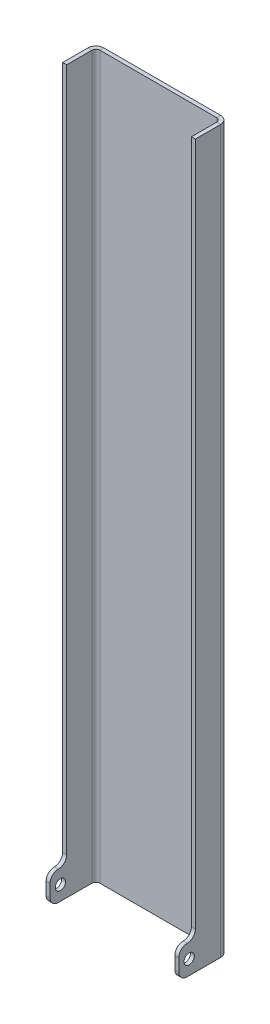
ISO-10303-21;
HEADER;
FILE_DESCRIPTION(('STEP AP214'),'2;1');
FILE_NAME('part.step','',(''),(''),'','','');
FILE_SCHEMA(('AUTOMOTIVE_DESIGN { 1 0 10303 214 1 1 1 1 }'));
ENDSEC;
DATA;
#1=APPLICATION_CONTEXT('core data for automotive mechanical design processes');
#2=APPLICATION_PROTOCOL_DEFINITION('international standard','automotive_design',2000,#1);
#3=PRODUCT_CONTEXT('',#1,'mechanical');
#4=PRODUCT('Part','Part','',(#3));
#5=PRODUCT_RELATED_PRODUCT_CATEGORY('part','',(#4));
#6=PRODUCT_DEFINITION_FORMATION('','',#4);
#7=PRODUCT_DEFINITION_CONTEXT('part definition',#1,'design');
#8=PRODUCT_DEFINITION('design','',#6,#7);
#9=PRODUCT_DEFINITION_SHAPE('','',#8);
#10=(LENGTH_UNIT() NAMED_UNIT(*) SI_UNIT(.MILLI.,.METRE.));
#11=(NAMED_UNIT(*) PLANE_ANGLE_UNIT() SI_UNIT($,.RADIAN.));
#12=(NAMED_UNIT(*) SI_UNIT($,.STERADIAN.) SOLID_ANGLE_UNIT());
#13=UNCERTAINTY_MEASURE_WITH_UNIT(LENGTH_MEASURE(1.E-05),#10,'distance_accuracy_value','');
#14=(GEOMETRIC_REPRESENTATION_CONTEXT(3) GLOBAL_UNCERTAINTY_ASSIGNED_CONTEXT((#13)) GLOBAL_UNIT_ASSIGNED_CONTEXT((#10,
#11,#12)) REPRESENTATION_CONTEXT('',''));
#15=CARTESIAN_POINT('',(0.,0.,0.));
#16=DIRECTION('',(0.,0.,1.));
#17=DIRECTION('',(1.,0.,0.));
#18=AXIS2_PLACEMENT_3D('',#15,#16,#17);
#19=CARTESIAN_POINT('',(-44.72432,552.45,0.));
#20=DIRECTION('',(0.,1.,0.));
#21=DIRECTION('',(0.,0.,1.));
#22=AXIS2_PLACEMENT_3D('',#19,#20,#21);
#23=PLANE('',#22);
#24=DIRECTION('',(0.,0.,1.));
#25=VECTOR('',#24,1.);
#26=CARTESIAN_POINT('',(-44.72432,552.45,0.));
#27=LINE('',#26,#25);
#28=CARTESIAN_POINT('',(-44.72432,552.45,0.));
#29=VERTEX_POINT('',#28);
#30=CARTESIAN_POINT('',(-44.72432,552.45,3.03784));
#31=VERTEX_POINT('',#30);
#32=EDGE_CURVE('E322',#29,#31,#27,.T.);
#33=ORIENTED_EDGE('',*,*,#32,.F.);
#34=CARTESIAN_POINT('',(-44.72432,552.45,6.07568));
#35=DIRECTION('',(0.,1.,0.));
#36=DIRECTION('',(0.,0.,1.));
#37=AXIS2_PLACEMENT_3D('',#34,#35,#36);
#38=CIRCLE('',#37,6.07568);
#39=CARTESIAN_POINT('',(-50.8,552.45,6.07568));
#40=VERTEX_POINT('',#39);
#41=EDGE_CURVE('E231',#40,#29,#38,.F.);
#42=ORIENTED_EDGE('',*,*,#41,.F.);
#43=DIRECTION('',(-1.,0.,0.));
#44=VECTOR('',#43,1.);
#45=CARTESIAN_POINT('',(-47.76216,552.45,6.07568));
#46=LINE('',#45,#44);
#47=CARTESIAN_POINT('',(-47.76216,552.45,6.07568));
#48=VERTEX_POINT('',#47);
#49=EDGE_CURVE('E319',#48,#40,#46,.T.);
#50=ORIENTED_EDGE('',*,*,#49,.F.);
#51=CARTESIAN_POINT('',(-44.72432,552.45,6.07568));
#52=DIRECTION('',(0.,1.,0.));
#53=DIRECTION('',(1.,0.,0.));
#54=AXIS2_PLACEMENT_3D('',#51,#52,#53);
#55=CIRCLE('',#54,3.03784);
#56=EDGE_CURVE('E238',#48,#31,#55,.F.);
#57=ORIENTED_EDGE('',*,*,#56,.T.);
#58=EDGE_LOOP('',(#33,#42,#50,#57));
#59=FACE_BOUND('',#58,.T.);
#60=ADVANCED_FACE('F38',(#59),#23,.T.);
#61=CARTESIAN_POINT('',(-47.76216,552.45,6.07568));
#62=DIRECTION('',(0.,1.,0.));
#63=DIRECTION('',(0.,0.,1.));
#64=AXIS2_PLACEMENT_3D('',#61,#62,#63);
#65=PLANE('',#64);
#66=DIRECTION('',(1.,0.,0.));
#67=VECTOR('',#66,1.);
#68=CARTESIAN_POINT('',(-50.8,552.45,0.));
#69=LINE('',#68,#67);
#70=CARTESIAN_POINT('',(44.72432,552.45,0.));
#71=VERTEX_POINT('',#70);
#72=EDGE_CURVE('E228',#29,#71,#69,.T.);
#73=ORIENTED_EDGE('',*,*,#72,.F.);
#74=ORIENTED_EDGE('',*,*,#32,.T.);
#75=DIRECTION('',(1.,0.,0.));
#76=VECTOR('',#75,1.);
#77=CARTESIAN_POINT('',(-50.8,552.45,3.03784));
#78=LINE('',#77,#76);
#79=CARTESIAN_POINT('',(44.72432,552.45,3.03784));
#80=VERTEX_POINT('',#79);
#81=EDGE_CURVE('E241',#31,#80,#78,.T.);
#82=ORIENTED_EDGE('',*,*,#81,.T.);
#83=DIRECTION('',(0.,0.,-1.));
#84=VECTOR('',#83,1.);
#85=CARTESIAN_POINT('',(44.72432,552.45,3.03784));
#86=LINE('',#85,#84);
#87=EDGE_CURVE('E310',#80,#71,#86,.T.);
#88=ORIENTED_EDGE('',*,*,#87,.T.);
#89=EDGE_LOOP('',(#73,#74,#82,#88));
#90=FACE_BOUND('',#89,.T.);
#91=ADVANCED_FACE('F383',(#90),#65,.T.);
#92=CARTESIAN_POINT('',(-50.8,0.,6.07568));
#93=DIRECTION('',(0.,-1.,0.));
#94=DIRECTION('',(0.,0.,-1.));
#95=AXIS2_PLACEMENT_3D('',#92,#93,#94);
#96=PLANE('',#95);
#97=DIRECTION('',(1.,0.,0.));
#98=VECTOR('',#97,1.);
#99=CARTESIAN_POINT('',(-50.8,0.,6.07568));
#100=LINE('',#99,#98);
#101=CARTESIAN_POINT('',(-50.8,0.,6.07568));
#102=VERTEX_POINT('',#101);
#103=CARTESIAN_POINT('',(-47.76216,0.,6.07568));
#104=VERTEX_POINT('',#103);
#105=EDGE_CURVE('E316',#102,#104,#100,.T.);
#106=ORIENTED_EDGE('',*,*,#105,.F.);
#107=CARTESIAN_POINT('',(-44.72432,0.,6.07568));
#108=DIRECTION('',(0.,1.,0.));
#109=DIRECTION('',(0.,0.,1.));
#110=AXIS2_PLACEMENT_3D('',#107,#108,#109);
#111=CIRCLE('',#110,6.07568);
#112=CARTESIAN_POINT('',(-44.72432,0.,0.));
#113=VERTEX_POINT('',#112);
#114=EDGE_CURVE('E259',#102,#113,#111,.F.);
#115=ORIENTED_EDGE('',*,*,#114,.T.);
#116=DIRECTION('',(0.,0.,-1.));
#117=VECTOR('',#116,1.);
#118=CARTESIAN_POINT('',(-44.72432,0.,3.03784));
#119=LINE('',#118,#117);
#120=CARTESIAN_POINT('',(-44.72432,0.,3.03784));
#121=VERTEX_POINT('',#120);
#122=EDGE_CURVE('E314',#121,#113,#119,.T.);
#123=ORIENTED_EDGE('',*,*,#122,.F.);
#124=CARTESIAN_POINT('',(-44.72432,0.,6.07568));
#125=DIRECTION('',(0.,1.,0.));
#126=DIRECTION('',(1.,0.,0.));
#127=AXIS2_PLACEMENT_3D('',#124,#125,#126);
#128=CIRCLE('',#127,3.03784);
#129=EDGE_CURVE('E266',#104,#121,#128,.F.);
#130=ORIENTED_EDGE('',*,*,#129,.F.);
#131=EDGE_LOOP('',(#106,#115,#123,#130));
#132=FACE_BOUND('',#131,.T.);
#133=ADVANCED_FACE('F366',(#132),#96,.T.);
#134=CARTESIAN_POINT('',(-44.72432,0.,3.03784));
#135=DIRECTION('',(0.,-1.,0.));
#136=DIRECTION('',(0.,0.,-1.));
#137=AXIS2_PLACEMENT_3D('',#134,#135,#136);
#138=PLANE('',#137);
#139=DIRECTION('',(0.,0.,-1.));
#140=VECTOR('',#139,1.);
#141=CARTESIAN_POINT('',(-47.76216,0.,0.));
#142=LINE('',#141,#140);
#143=CARTESIAN_POINT('',(-47.76216,0.,31.75));
#144=VERTEX_POINT('',#143);
#145=EDGE_CURVE('E264',#144,#104,#142,.T.);
#146=ORIENTED_EDGE('',*,*,#145,.F.);
#147=DIRECTION('',(-1.,0.,0.));
#148=VECTOR('',#147,1.);
#149=CARTESIAN_POINT('',(-44.72432,0.,31.75));
#150=LINE('',#149,#148);
#151=CARTESIAN_POINT('',(-50.8,0.,31.75));
#152=VERTEX_POINT('',#151);
#153=EDGE_CURVE('E187',#144,#152,#150,.T.);
#154=ORIENTED_EDGE('',*,*,#153,.T.);
#155=DIRECTION('',(0.,0.,-1.));
#156=VECTOR('',#155,1.);
#157=CARTESIAN_POINT('',(-50.8,0.,0.));
#158=LINE('',#157,#156);
#159=EDGE_CURVE('E262',#152,#102,#158,.T.);
#160=ORIENTED_EDGE('',*,*,#159,.T.);
#161=ORIENTED_EDGE('',*,*,#105,.T.);
#162=EDGE_LOOP('',(#146,#154,#160,#161));
#163=FACE_BOUND('',#162,.T.);
#164=ADVANCED_FACE('F355',(#163),#138,.T.);
#165=CARTESIAN_POINT('',(50.8,552.45,6.07568));
#166=DIRECTION('',(0.,1.,0.));
#167=DIRECTION('',(0.,0.,1.));
#168=AXIS2_PLACEMENT_3D('',#165,#166,#167);
#169=PLANE('',#168);
#170=DIRECTION('',(-1.,0.,0.));
#171=VECTOR('',#170,1.);
#172=CARTESIAN_POINT('',(50.8,552.45,6.07568));
#173=LINE('',#172,#171);
#174=CARTESIAN_POINT('',(50.8,552.45,6.07568));
#175=VERTEX_POINT('',#174);
#176=CARTESIAN_POINT('',(47.76216,552.45,6.07568));
#177=VERTEX_POINT('',#176);
#178=EDGE_CURVE('E312',#175,#177,#173,.T.);
#179=ORIENTED_EDGE('',*,*,#178,.F.);
#180=CARTESIAN_POINT('',(44.72432,552.45,6.07568));
#181=DIRECTION('',(0.,1.,0.));
#182=DIRECTION('',(0.,0.,1.));
#183=AXIS2_PLACEMENT_3D('',#180,#181,#182);
#184=CIRCLE('',#183,6.07568);
#185=EDGE_CURVE('E225',#71,#175,#184,.F.);
#186=ORIENTED_EDGE('',*,*,#185,.F.);
#187=ORIENTED_EDGE('',*,*,#87,.F.);
#188=CARTESIAN_POINT('',(44.72432,552.45,6.07568));
#189=DIRECTION('',(0.,1.,0.));
#190=DIRECTION('',(1.,0.,0.));
#191=AXIS2_PLACEMENT_3D('',#188,#189,#190);
#192=CIRCLE('',#191,3.03784);
#193=EDGE_CURVE('E244',#80,#177,#192,.F.);
#194=ORIENTED_EDGE('',*,*,#193,.T.);
#195=EDGE_LOOP('',(#179,#186,#187,#194));
#196=FACE_BOUND('',#195,.T.);
#197=ADVANCED_FACE('F392',(#196),#169,.T.);
#198=CARTESIAN_POINT('',(44.72432,552.45,3.03784));
#199=DIRECTION('',(0.,1.,0.));
#200=DIRECTION('',(0.,0.,1.));
#201=AXIS2_PLACEMENT_3D('',#198,#199,#200);
#202=PLANE('',#201);
#203=DIRECTION('',(1.,0.,0.));
#204=VECTOR('',#203,1.);
#205=CARTESIAN_POINT('',(-50.8,552.45,25.4));
#206=LINE('',#205,#204);
#207=CARTESIAN_POINT('',(47.76216,552.45,25.3999999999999));
#208=VERTEX_POINT('',#207);
#209=CARTESIAN_POINT('',(50.8,552.45,25.3999999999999));
#210=VERTEX_POINT('',#209);
#211=EDGE_CURVE('E404',#208,#210,#206,.T.);
#212=ORIENTED_EDGE('',*,*,#211,.T.);
#213=DIRECTION('',(0.,0.,1.));
#214=VECTOR('',#213,1.);
#215=CARTESIAN_POINT('',(50.8,552.45,0.));
#216=LINE('',#215,#214);
#217=EDGE_CURVE('E221',#175,#210,#216,.T.);
#218=ORIENTED_EDGE('',*,*,#217,.F.);
#219=ORIENTED_EDGE('',*,*,#178,.T.);
#220=DIRECTION('',(0.,0.,1.));
#221=VECTOR('',#220,1.);
#222=CARTESIAN_POINT('',(47.76216,552.45,0.));
#223=LINE('',#222,#221);
#224=EDGE_CURVE('E218',#177,#208,#223,.T.);
#225=ORIENTED_EDGE('',*,*,#224,.T.);
#226=EDGE_LOOP('',(#212,#218,#219,#225));
#227=FACE_BOUND('',#226,.T.);
#228=ADVANCED_FACE('F403',(#227),#202,.T.);
#229=CARTESIAN_POINT('',(44.72432,0.,0.));
#230=DIRECTION('',(0.,-1.,0.));
#231=DIRECTION('',(0.,0.,-1.));
#232=AXIS2_PLACEMENT_3D('',#229,#230,#231);
#233=PLANE('',#232);
#234=DIRECTION('',(0.,0.,1.));
#235=VECTOR('',#234,1.);
#236=CARTESIAN_POINT('',(44.72432,0.,0.));
#237=LINE('',#236,#235);
#238=CARTESIAN_POINT('',(44.72432,0.,0.));
#239=VERTEX_POINT('',#238);
#240=CARTESIAN_POINT('',(44.72432,0.,3.03784));
#241=VERTEX_POINT('',#240);
#242=EDGE_CURVE('E308',#239,#241,#237,.T.);
#243=ORIENTED_EDGE('',*,*,#242,.F.);
#244=CARTESIAN_POINT('',(44.72432,0.,6.07568));
#245=DIRECTION('',(0.,1.,0.));
#246=DIRECTION('',(0.,0.,1.));
#247=AXIS2_PLACEMENT_3D('',#244,#245,#246);
#248=CIRCLE('',#247,6.07568);
#249=CARTESIAN_POINT('',(50.8,0.,6.07568));
#250=VERTEX_POINT('',#249);
#251=EDGE_CURVE('E253',#239,#250,#248,.F.);
#252=ORIENTED_EDGE('',*,*,#251,.T.);
#253=DIRECTION('',(1.,0.,0.));
#254=VECTOR('',#253,1.);
#255=CARTESIAN_POINT('',(47.76216,0.,6.07568));
#256=LINE('',#255,#254);
#257=CARTESIAN_POINT('',(47.76216,0.,6.07568));
#258=VERTEX_POINT('',#257);
#259=EDGE_CURVE('E306',#258,#250,#256,.T.);
#260=ORIENTED_EDGE('',*,*,#259,.F.);
#261=CARTESIAN_POINT('',(44.72432,0.,6.07568));
#262=DIRECTION('',(0.,1.,0.));
#263=DIRECTION('',(1.,0.,0.));
#264=AXIS2_PLACEMENT_3D('',#261,#262,#263);
#265=CIRCLE('',#264,3.03784);
#266=EDGE_CURVE('E222',#241,#258,#265,.F.);
#267=ORIENTED_EDGE('',*,*,#266,.F.);
#268=EDGE_LOOP('',(#243,#252,#260,#267));
#269=FACE_BOUND('',#268,.T.);
#270=ADVANCED_FACE('F675',(#269),#233,.T.);
#271=CARTESIAN_POINT('',(47.76216,0.,6.07568));
#272=DIRECTION('',(0.,-1.,0.));
#273=DIRECTION('',(0.,0.,-1.));
#274=AXIS2_PLACEMENT_3D('',#271,#272,#273);
#275=PLANE('',#274);
#276=DIRECTION('',(1.,0.,0.));
#277=VECTOR('',#276,1.);
#278=CARTESIAN_POINT('',(-50.8,0.,0.));
#279=LINE('',#278,#277);
#280=EDGE_CURVE('E256',#113,#239,#279,.T.);
#281=ORIENTED_EDGE('',*,*,#280,.T.);
#282=ORIENTED_EDGE('',*,*,#242,.T.);
#283=DIRECTION('',(1.,0.,0.));
#284=VECTOR('',#283,1.);
#285=CARTESIAN_POINT('',(-50.8,0.,3.03784));
#286=LINE('',#285,#284);
#287=EDGE_CURVE('E269',#121,#241,#286,.T.);
#288=ORIENTED_EDGE('',*,*,#287,.F.);
#289=ORIENTED_EDGE('',*,*,#122,.T.);
#290=EDGE_LOOP('',(#281,#282,#288,#289));
#291=FACE_BOUND('',#290,.T.);
#292=ADVANCED_FACE('F474',(#291),#275,.T.);
#293=CARTESIAN_POINT('',(47.76216,552.45,0.));
#294=DIRECTION('',(1.,0.,0.));
#295=DIRECTION('',(0.,0.,-1.));
#296=AXIS2_PLACEMENT_3D('',#293,#294,#295);
#297=PLANE('',#296);
#298=CARTESIAN_POINT('',(47.76216,11.1125,30.1625));
#299=DIRECTION('',(1.,0.,0.));
#300=DIRECTION('',(0.,0.,-1.));
#301=AXIS2_PLACEMENT_3D('',#298,#299,#300);
#302=CIRCLE('',#301,3.96875);
#303=CARTESIAN_POINT('',(47.76216,11.1125,26.19375));
#304=VERTEX_POINT('',#303);
#305=EDGE_CURVE('E412',#304,#304,#302,.T.);
#306=ORIENTED_EDGE('',*,*,#305,.T.);
#307=EDGE_LOOP('',(#306));
#308=FACE_BOUND('',#307,.T.);
#309=DIRECTION('',(0.,0.,1.));
#310=VECTOR('',#309,1.);
#311=CARTESIAN_POINT('',(47.76216,0.,0.));
#312=LINE('',#311,#310);
#313=CARTESIAN_POINT('',(47.76216,0.,31.75));
#314=VERTEX_POINT('',#313);
#315=EDGE_CURVE('E217',#258,#314,#312,.T.);
#316=ORIENTED_EDGE('',*,*,#315,.T.);
#317=CARTESIAN_POINT('',(47.76216,6.35,31.75));
#318=DIRECTION('',(1.,0.,0.));
#319=DIRECTION('',(0.,0.,-1.));
#320=AXIS2_PLACEMENT_3D('',#317,#318,#319);
#321=CIRCLE('',#320,6.35);
#322=CARTESIAN_POINT('',(47.76216,6.34999999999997,38.1));
#323=VERTEX_POINT('',#322);
#324=EDGE_CURVE('E331',#314,#323,#321,.F.);
#325=ORIENTED_EDGE('',*,*,#324,.T.);
#326=DIRECTION('',(0.,-1.,0.));
#327=VECTOR('',#326,1.);
#328=CARTESIAN_POINT('',(47.76216,552.45,38.1));
#329=LINE('',#328,#327);
#330=CARTESIAN_POINT('',(47.76216,15.875,38.1));
#331=VERTEX_POINT('',#330);
#332=EDGE_CURVE('E303',#331,#323,#329,.T.);
#333=ORIENTED_EDGE('',*,*,#332,.F.);
#334=CARTESIAN_POINT('',(47.76216,15.875,31.75));
#335=DIRECTION('',(1.,0.,0.));
#336=DIRECTION('',(0.,0.,-1.));
#337=AXIS2_PLACEMENT_3D('',#334,#335,#336);
#338=CIRCLE('',#337,6.35);
#339=CARTESIAN_POINT('',(47.76216,22.225,31.7499999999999));
#340=VERTEX_POINT('',#339);
#341=EDGE_CURVE('E329',#331,#340,#338,.F.);
#342=ORIENTED_EDGE('',*,*,#341,.T.);
#343=CARTESIAN_POINT('',(47.76216,28.575,31.7499999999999));
#344=DIRECTION('',(1.,0.,0.));
#345=DIRECTION('',(0.,0.,-1.));
#346=AXIS2_PLACEMENT_3D('',#343,#344,#345);
#347=CIRCLE('',#346,6.35);
#348=CARTESIAN_POINT('',(47.76216,28.575,25.3999999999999));
#349=VERTEX_POINT('',#348);
#350=EDGE_CURVE('E214',#340,#349,#347,.T.);
#351=ORIENTED_EDGE('',*,*,#350,.T.);
#352=DIRECTION('',(0.,1.,0.));
#353=VECTOR('',#352,1.);
#354=CARTESIAN_POINT('',(47.76216,552.45,25.3999999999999));
#355=LINE('',#354,#353);
#356=EDGE_CURVE('E210',#349,#208,#355,.T.);
#357=ORIENTED_EDGE('',*,*,#356,.T.);
#358=ORIENTED_EDGE('',*,*,#224,.F.);
#359=DIRECTION('',(0.,-1.,0.));
#360=VECTOR('',#359,1.);
#361=CARTESIAN_POINT('',(47.76216,552.45,6.07568));
#362=LINE('',#361,#360);
#363=EDGE_CURVE('E247',#177,#258,#362,.T.);
#364=ORIENTED_EDGE('',*,*,#363,.T.);
#365=EDGE_LOOP('',(#316,#325,#333,#342,#351,#357,#358,#364));
#366=FACE_BOUND('',#365,.T.);
#367=ADVANCED_FACE('F468',(#308,#366),#297,.F.);
#368=CARTESIAN_POINT('',(50.8,552.45,38.1));
#369=DIRECTION('',(0.,0.,1.));
#370=DIRECTION('',(1.,0.,0.));
#371=AXIS2_PLACEMENT_3D('',#368,#369,#370);
#372=PLANE('',#371);
#373=ORIENTED_EDGE('',*,*,#332,.T.);
#374=DIRECTION('',(-1.,0.,0.));
#375=VECTOR('',#374,1.);
#376=CARTESIAN_POINT('',(50.8,6.35,38.1));
#377=LINE('',#376,#375);
#378=CARTESIAN_POINT('',(50.8,6.34999999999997,38.1));
#379=VERTEX_POINT('',#378);
#380=EDGE_CURVE('E335',#323,#379,#377,.F.);
#381=ORIENTED_EDGE('',*,*,#380,.T.);
#382=DIRECTION('',(0.,-1.,0.));
#383=VECTOR('',#382,1.);
#384=CARTESIAN_POINT('',(50.8,552.45,38.1));
#385=LINE('',#384,#383);
#386=CARTESIAN_POINT('',(50.8,15.875,38.1));
#387=VERTEX_POINT('',#386);
#388=EDGE_CURVE('E300',#387,#379,#385,.T.);
#389=ORIENTED_EDGE('',*,*,#388,.F.);
#390=DIRECTION('',(1.,0.,0.));
#391=VECTOR('',#390,1.);
#392=CARTESIAN_POINT('',(47.76216,15.875,38.1));
#393=LINE('',#392,#391);
#394=EDGE_CURVE('E333',#387,#331,#393,.F.);
#395=ORIENTED_EDGE('',*,*,#394,.T.);
#396=EDGE_LOOP('',(#373,#381,#389,#395));
#397=FACE_BOUND('',#396,.T.);
#398=ADVANCED_FACE('F473',(#397),#372,.T.);
#399=CARTESIAN_POINT('',(50.8,552.45,0.));
#400=DIRECTION('',(1.,0.,0.));
#401=DIRECTION('',(0.,0.,-1.));
#402=AXIS2_PLACEMENT_3D('',#399,#400,#401);
#403=PLANE('',#402);
#404=CARTESIAN_POINT('',(50.8,11.1125,30.1625));
#405=DIRECTION('',(1.,0.,0.));
#406=DIRECTION('',(0.,0.,-1.));
#407=AXIS2_PLACEMENT_3D('',#404,#405,#406);
#408=CIRCLE('',#407,3.96875);
#409=CARTESIAN_POINT('',(50.8,11.1125,26.19375));
#410=VERTEX_POINT('',#409);
#411=EDGE_CURVE('E416',#410,#410,#408,.T.);
#412=ORIENTED_EDGE('',*,*,#411,.F.);
#413=EDGE_LOOP('',(#412));
#414=FACE_BOUND('',#413,.T.);
#415=ORIENTED_EDGE('',*,*,#388,.T.);
#416=CARTESIAN_POINT('',(50.8,6.35,31.75));
#417=DIRECTION('',(1.,0.,0.));
#418=DIRECTION('',(0.,0.,-1.));
#419=AXIS2_PLACEMENT_3D('',#416,#417,#418);
#420=CIRCLE('',#419,6.35);
#421=CARTESIAN_POINT('',(50.8,0.,31.75));
#422=VERTEX_POINT('',#421);
#423=EDGE_CURVE('E339',#379,#422,#420,.T.);
#424=ORIENTED_EDGE('',*,*,#423,.T.);
#425=DIRECTION('',(0.,0.,1.));
#426=VECTOR('',#425,1.);
#427=CARTESIAN_POINT('',(50.8,0.,0.));
#428=LINE('',#427,#426);
#429=EDGE_CURVE('E250',#250,#422,#428,.T.);
#430=ORIENTED_EDGE('',*,*,#429,.F.);
#431=DIRECTION('',(0.,-1.,0.));
#432=VECTOR('',#431,1.);
#433=CARTESIAN_POINT('',(50.8,552.45,6.07568));
#434=LINE('',#433,#432);
#435=EDGE_CURVE('E297',#175,#250,#434,.T.);
#436=ORIENTED_EDGE('',*,*,#435,.F.);
#437=ORIENTED_EDGE('',*,*,#217,.T.);
#438=DIRECTION('',(0.,1.,0.));
#439=VECTOR('',#438,1.);
#440=CARTESIAN_POINT('',(50.8,28.575,25.3999999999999));
#441=LINE('',#440,#439);
#442=CARTESIAN_POINT('',(50.8,28.575,25.3999999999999));
#443=VERTEX_POINT('',#442);
#444=EDGE_CURVE('E197',#443,#210,#441,.T.);
#445=ORIENTED_EDGE('',*,*,#444,.F.);
#446=CARTESIAN_POINT('',(50.8,28.575,31.7499999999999));
#447=DIRECTION('',(1.,0.,0.));
#448=DIRECTION('',(0.,0.,-1.));
#449=AXIS2_PLACEMENT_3D('',#446,#447,#448);
#450=CIRCLE('',#449,6.35);
#451=CARTESIAN_POINT('',(50.8,22.225,31.7499999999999));
#452=VERTEX_POINT('',#451);
#453=EDGE_CURVE('E409',#452,#443,#450,.T.);
#454=ORIENTED_EDGE('',*,*,#453,.F.);
#455=CARTESIAN_POINT('',(50.8,15.875,31.75));
#456=DIRECTION('',(1.,0.,0.));
#457=DIRECTION('',(0.,0.,-1.));
#458=AXIS2_PLACEMENT_3D('',#455,#456,#457);
#459=CIRCLE('',#458,6.35);
#460=EDGE_CURVE('E337',#452,#387,#459,.T.);
#461=ORIENTED_EDGE('',*,*,#460,.T.);
#462=EDGE_LOOP('',(#415,#424,#430,#436,#437,#445,#454,#461));
#463=FACE_BOUND('',#462,.T.);
#464=ADVANCED_FACE('F400',(#414,#463),#403,.T.);
#465=CARTESIAN_POINT('',(44.72432,552.45,6.07568));
#466=DIRECTION('',(0.,-1.,0.));
#467=DIRECTION('',(0.,0.,-1.));
#468=AXIS2_PLACEMENT_3D('',#465,#466,#467);
#469=CYLINDRICAL_SURFACE('',#468,6.07568);
#470=ORIENTED_EDGE('',*,*,#251,.F.);
#471=DIRECTION('',(0.,-1.,0.));
#472=VECTOR('',#471,1.);
#473=CARTESIAN_POINT('',(44.72432,552.45,0.));
#474=LINE('',#473,#472);
#475=EDGE_CURVE('E294',#71,#239,#474,.T.);
#476=ORIENTED_EDGE('',*,*,#475,.F.);
#477=ORIENTED_EDGE('',*,*,#185,.T.);
#478=ORIENTED_EDGE('',*,*,#435,.T.);
#479=EDGE_LOOP('',(#470,#476,#477,#478));
#480=FACE_BOUND('',#479,.T.);
#481=ADVANCED_FACE('F391',(#480),#469,.T.);
#482=CARTESIAN_POINT('',(-50.8,552.45,0.));
#483=DIRECTION('',(0.,0.,-1.));
#484=DIRECTION('',(-1.,0.,0.));
#485=AXIS2_PLACEMENT_3D('',#482,#483,#484);
#486=PLANE('',#485);
#487=ORIENTED_EDGE('',*,*,#280,.F.);
#488=DIRECTION('',(0.,-1.,0.));
#489=VECTOR('',#488,1.);
#490=CARTESIAN_POINT('',(-44.72432,552.45,0.));
#491=LINE('',#490,#489);
#492=EDGE_CURVE('E291',#29,#113,#491,.T.);
#493=ORIENTED_EDGE('',*,*,#492,.F.);
#494=ORIENTED_EDGE('',*,*,#72,.T.);
#495=ORIENTED_EDGE('',*,*,#475,.T.);
#496=EDGE_LOOP('',(#487,#493,#494,#495));
#497=FACE_BOUND('',#496,.T.);
#498=ADVANCED_FACE('F382',(#497),#486,.T.);
#499=CARTESIAN_POINT('',(-44.72432,552.45,6.07568));
#500=DIRECTION('',(0.,-1.,0.));
#501=DIRECTION('',(0.,0.,-1.));
#502=AXIS2_PLACEMENT_3D('',#499,#500,#501);
#503=CYLINDRICAL_SURFACE('',#502,6.07568);
#504=ORIENTED_EDGE('',*,*,#114,.F.);
#505=DIRECTION('',(0.,-1.,0.));
#506=VECTOR('',#505,1.);
#507=CARTESIAN_POINT('',(-50.8,552.45,6.07568));
#508=LINE('',#507,#506);
#509=EDGE_CURVE('E288',#40,#102,#508,.T.);
#510=ORIENTED_EDGE('',*,*,#509,.F.);
#511=ORIENTED_EDGE('',*,*,#41,.T.);
#512=ORIENTED_EDGE('',*,*,#492,.T.);
#513=EDGE_LOOP('',(#504,#510,#511,#512));
#514=FACE_BOUND('',#513,.T.);
#515=ADVANCED_FACE('F362',(#514),#503,.T.);
#516=CARTESIAN_POINT('',(-50.8,552.45,0.));
#517=DIRECTION('',(-1.,0.,0.));
#518=DIRECTION('',(0.,0.,1.));
#519=AXIS2_PLACEMENT_3D('',#516,#517,#518);
#520=PLANE('',#519);
#521=CARTESIAN_POINT('',(-50.8,11.1125,30.1625));
#522=DIRECTION('',(1.,0.,0.));
#523=DIRECTION('',(0.,0.,-1.));
#524=AXIS2_PLACEMENT_3D('',#521,#522,#523);
#525=CIRCLE('',#524,3.96875);
#526=CARTESIAN_POINT('',(-50.8,11.1125,26.19375));
#527=VERTEX_POINT('',#526);
#528=EDGE_CURVE('E419',#527,#527,#525,.T.);
#529=ORIENTED_EDGE('',*,*,#528,.T.);
#530=EDGE_LOOP('',(#529));
#531=FACE_BOUND('',#530,.T.);
#532=ORIENTED_EDGE('',*,*,#159,.F.);
#533=CARTESIAN_POINT('',(-50.8,6.35,31.75));
#534=DIRECTION('',(-1.,0.,0.));
#535=DIRECTION('',(0.,0.,1.));
#536=AXIS2_PLACEMENT_3D('',#533,#534,#535);
#537=CIRCLE('',#536,6.35);
#538=CARTESIAN_POINT('',(-50.8,6.34999999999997,38.1));
#539=VERTEX_POINT('',#538);
#540=EDGE_CURVE('E186',#152,#539,#537,.T.);
#541=ORIENTED_EDGE('',*,*,#540,.T.);
#542=DIRECTION('',(0.,-1.,0.));
#543=VECTOR('',#542,1.);
#544=CARTESIAN_POINT('',(-50.8,552.45,38.1));
#545=LINE('',#544,#543);
#546=CARTESIAN_POINT('',(-50.8,15.875,38.1));
#547=VERTEX_POINT('',#546);
#548=EDGE_CURVE('E182',#547,#539,#545,.T.);
#549=ORIENTED_EDGE('',*,*,#548,.F.);
#550=CARTESIAN_POINT('',(-50.8,15.875,31.75));
#551=DIRECTION('',(-1.,0.,0.));
#552=DIRECTION('',(0.,0.,1.));
#553=AXIS2_PLACEMENT_3D('',#550,#551,#552);
#554=CIRCLE('',#553,6.35);
#555=CARTESIAN_POINT('',(-50.8,22.225,31.75));
#556=VERTEX_POINT('',#555);
#557=EDGE_CURVE('E176',#547,#556,#554,.T.);
#558=ORIENTED_EDGE('',*,*,#557,.T.);
#559=CARTESIAN_POINT('',(-50.8,28.575,31.75));
#560=DIRECTION('',(1.,0.,0.));
#561=DIRECTION('',(0.,0.,-1.));
#562=AXIS2_PLACEMENT_3D('',#559,#560,#561);
#563=CIRCLE('',#562,6.35);
#564=CARTESIAN_POINT('',(-50.8,28.575,25.4));
#565=VERTEX_POINT('',#564);
#566=EDGE_CURVE('E181',#556,#565,#563,.T.);
#567=ORIENTED_EDGE('',*,*,#566,.T.);
#568=DIRECTION('',(0.,1.,0.));
#569=VECTOR('',#568,1.);
#570=CARTESIAN_POINT('',(-50.8,28.575,25.4));
#571=LINE('',#570,#569);
#572=CARTESIAN_POINT('',(-50.8,552.45,25.4));
#573=VERTEX_POINT('',#572);
#574=EDGE_CURVE('E196',#565,#573,#571,.T.);
#575=ORIENTED_EDGE('',*,*,#574,.T.);
#576=DIRECTION('',(0.,0.,-1.));
#577=VECTOR('',#576,1.);
#578=CARTESIAN_POINT('',(-50.8,552.45,0.));
#579=LINE('',#578,#577);
#580=EDGE_CURVE('E234',#573,#40,#579,.T.);
#581=ORIENTED_EDGE('',*,*,#580,.T.);
#582=ORIENTED_EDGE('',*,*,#509,.T.);
#583=EDGE_LOOP('',(#532,#541,#549,#558,#567,#575,#581,#582));
#584=FACE_BOUND('',#583,.T.);
#585=ADVANCED_FACE('F179',(#531,#584),#520,.T.);
#586=CARTESIAN_POINT('',(-47.76216,552.45,38.1));
#587=DIRECTION('',(0.,0.,1.));
#588=DIRECTION('',(1.,0.,0.));
#589=AXIS2_PLACEMENT_3D('',#586,#587,#588);
#590=PLANE('',#589);
#591=ORIENTED_EDGE('',*,*,#548,.T.);
#592=DIRECTION('',(-1.,0.,0.));
#593=VECTOR('',#592,1.);
#594=CARTESIAN_POINT('',(-47.76216,6.34999999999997,38.1));
#595=LINE('',#594,#593);
#596=CARTESIAN_POINT('',(-47.76216,6.34999999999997,38.1));
#597=VERTEX_POINT('',#596);
#598=EDGE_CURVE('E54',#539,#597,#595,.F.);
#599=ORIENTED_EDGE('',*,*,#598,.T.);
#600=DIRECTION('',(0.,-1.,0.));
#601=VECTOR('',#600,1.);
#602=CARTESIAN_POINT('',(-47.76216,552.45,38.1));
#603=LINE('',#602,#601);
#604=CARTESIAN_POINT('',(-47.76216,15.875,38.1));
#605=VERTEX_POINT('',#604);
#606=EDGE_CURVE('E285',#605,#597,#603,.T.);
#607=ORIENTED_EDGE('',*,*,#606,.F.);
#608=DIRECTION('',(1.,0.,0.));
#609=VECTOR('',#608,1.);
#610=CARTESIAN_POINT('',(-50.8,15.875,38.1));
#611=LINE('',#610,#609);
#612=EDGE_CURVE('E344',#605,#547,#611,.F.);
#613=ORIENTED_EDGE('',*,*,#612,.T.);
#614=EDGE_LOOP('',(#591,#599,#607,#613));
#615=FACE_BOUND('',#614,.T.);
#616=ADVANCED_FACE('F347',(#615),#590,.T.);
#617=CARTESIAN_POINT('',(-47.76216,552.45,0.));
#618=DIRECTION('',(-1.,0.,0.));
#619=DIRECTION('',(0.,0.,1.));
#620=AXIS2_PLACEMENT_3D('',#617,#618,#619);
#621=PLANE('',#620);
#622=CARTESIAN_POINT('',(-47.76216,11.1125,30.1625));
#623=DIRECTION('',(-1.,0.,0.));
#624=DIRECTION('',(0.,0.,1.));
#625=AXIS2_PLACEMENT_3D('',#622,#623,#624);
#626=CIRCLE('',#625,3.96875);
#627=CARTESIAN_POINT('',(-47.76216,11.1125,34.13125));
#628=VERTEX_POINT('',#627);
#629=EDGE_CURVE('E42',#628,#628,#626,.T.);
#630=ORIENTED_EDGE('',*,*,#629,.T.);
#631=EDGE_LOOP('',(#630));
#632=FACE_BOUND('',#631,.T.);
#633=ORIENTED_EDGE('',*,*,#606,.T.);
#634=CARTESIAN_POINT('',(-47.76216,6.35,31.75));
#635=DIRECTION('',(-1.,0.,0.));
#636=DIRECTION('',(0.,0.,1.));
#637=AXIS2_PLACEMENT_3D('',#634,#635,#636);
#638=CIRCLE('',#637,6.35);
#639=EDGE_CURVE('E11',#597,#144,#638,.F.);
#640=ORIENTED_EDGE('',*,*,#639,.T.);
#641=ORIENTED_EDGE('',*,*,#145,.T.);
#642=DIRECTION('',(0.,-1.,0.));
#643=VECTOR('',#642,1.);
#644=CARTESIAN_POINT('',(-47.76216,552.45,6.07568));
#645=LINE('',#644,#643);
#646=EDGE_CURVE('E282',#48,#104,#645,.T.);
#647=ORIENTED_EDGE('',*,*,#646,.F.);
#648=DIRECTION('',(0.,0.,-1.));
#649=VECTOR('',#648,1.);
#650=CARTESIAN_POINT('',(-47.76216,552.45,0.));
#651=LINE('',#650,#649);
#652=CARTESIAN_POINT('',(-47.76216,552.45,25.3999999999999));
#653=VERTEX_POINT('',#652);
#654=EDGE_CURVE('E236',#653,#48,#651,.T.);
#655=ORIENTED_EDGE('',*,*,#654,.F.);
#656=DIRECTION('',(0.,-1.,0.));
#657=VECTOR('',#656,1.);
#658=CARTESIAN_POINT('',(-47.76216,552.45,25.4));
#659=LINE('',#658,#657);
#660=CARTESIAN_POINT('',(-47.76216,28.575,25.4));
#661=VERTEX_POINT('',#660);
#662=EDGE_CURVE('E207',#653,#661,#659,.T.);
#663=ORIENTED_EDGE('',*,*,#662,.T.);
#664=CARTESIAN_POINT('',(-47.76216,28.575,31.75));
#665=DIRECTION('',(-1.,0.,0.));
#666=DIRECTION('',(0.,0.,1.));
#667=AXIS2_PLACEMENT_3D('',#664,#665,#666);
#668=CIRCLE('',#667,6.35);
#669=CARTESIAN_POINT('',(-47.76216,22.225,31.75));
#670=VERTEX_POINT('',#669);
#671=EDGE_CURVE('E324',#661,#670,#668,.T.);
#672=ORIENTED_EDGE('',*,*,#671,.T.);
#673=CARTESIAN_POINT('',(-47.76216,15.875,31.75));
#674=DIRECTION('',(-1.,0.,0.));
#675=DIRECTION('',(0.,0.,1.));
#676=AXIS2_PLACEMENT_3D('',#673,#674,#675);
#677=CIRCLE('',#676,6.35);
#678=EDGE_CURVE('E47',#670,#605,#677,.F.);
#679=ORIENTED_EDGE('',*,*,#678,.T.);
#680=EDGE_LOOP('',(#633,#640,#641,#647,#655,#663,#672,#679));
#681=FACE_BOUND('',#680,.T.);
#682=ADVANCED_FACE('F349',(#632,#681),#621,.F.);
#683=CARTESIAN_POINT('',(-44.72432,552.45,6.07568));
#684=DIRECTION('',(0.,-1.,0.));
#685=DIRECTION('',(0.,0.,-1.));
#686=AXIS2_PLACEMENT_3D('',#683,#684,#685);
#687=CYLINDRICAL_SURFACE('',#686,3.03784);
#688=ORIENTED_EDGE('',*,*,#129,.T.);
#689=DIRECTION('',(0.,-1.,0.));
#690=VECTOR('',#689,1.);
#691=CARTESIAN_POINT('',(-44.72432,552.45,3.03784));
#692=LINE('',#691,#690);
#693=EDGE_CURVE('E279',#31,#121,#692,.T.);
#694=ORIENTED_EDGE('',*,*,#693,.F.);
#695=ORIENTED_EDGE('',*,*,#56,.F.);
#696=ORIENTED_EDGE('',*,*,#646,.T.);
#697=EDGE_LOOP('',(#688,#694,#695,#696));
#698=FACE_BOUND('',#697,.T.);
#699=ADVANCED_FACE('F371',(#698),#687,.F.);
#700=CARTESIAN_POINT('',(-50.8,552.45,3.03784));
#701=DIRECTION('',(0.,0.,-1.));
#702=DIRECTION('',(-1.,0.,0.));
#703=AXIS2_PLACEMENT_3D('',#700,#701,#702);
#704=PLANE('',#703);
#705=ORIENTED_EDGE('',*,*,#287,.T.);
#706=DIRECTION('',(0.,-1.,0.));
#707=VECTOR('',#706,1.);
#708=CARTESIAN_POINT('',(44.72432,552.45,3.03784));
#709=LINE('',#708,#707);
#710=EDGE_CURVE('E276',#80,#241,#709,.T.);
#711=ORIENTED_EDGE('',*,*,#710,.F.);
#712=ORIENTED_EDGE('',*,*,#81,.F.);
#713=ORIENTED_EDGE('',*,*,#693,.T.);
#714=EDGE_LOOP('',(#705,#711,#712,#713));
#715=FACE_BOUND('',#714,.T.);
#716=ADVANCED_FACE('F534',(#715),#704,.F.);
#717=CARTESIAN_POINT('',(44.72432,552.45,6.07568));
#718=DIRECTION('',(0.,-1.,0.));
#719=DIRECTION('',(0.,0.,-1.));
#720=AXIS2_PLACEMENT_3D('',#717,#718,#719);
#721=CYLINDRICAL_SURFACE('',#720,3.03784);
#722=ORIENTED_EDGE('',*,*,#266,.T.);
#723=ORIENTED_EDGE('',*,*,#363,.F.);
#724=ORIENTED_EDGE('',*,*,#193,.F.);
#725=ORIENTED_EDGE('',*,*,#710,.T.);
#726=EDGE_LOOP('',(#722,#723,#724,#725));
#727=FACE_BOUND('',#726,.T.);
#728=ADVANCED_FACE('F541',(#727),#721,.F.);
#729=CARTESIAN_POINT('',(44.72432,552.45,6.07568));
#730=DIRECTION('',(0.,1.,0.));
#731=DIRECTION('',(1.,0.,0.));
#732=AXIS2_PLACEMENT_3D('',#729,#730,#731);
#733=PLANE('',#732);
#734=EDGE_CURVE('E211',#573,#653,#206,.T.);
#735=ORIENTED_EDGE('',*,*,#734,.T.);
#736=ORIENTED_EDGE('',*,*,#654,.T.);
#737=ORIENTED_EDGE('',*,*,#49,.T.);
#738=ORIENTED_EDGE('',*,*,#580,.F.);
#739=EDGE_LOOP('',(#735,#736,#737,#738));
#740=FACE_BOUND('',#739,.T.);
#741=ADVANCED_FACE('F377',(#740),#733,.T.);
#742=CARTESIAN_POINT('',(44.72432,0.,6.07568));
#743=DIRECTION('',(0.,1.,0.));
#744=DIRECTION('',(1.,0.,0.));
#745=AXIS2_PLACEMENT_3D('',#742,#743,#744);
#746=PLANE('',#745);
#747=ORIENTED_EDGE('',*,*,#429,.T.);
#748=DIRECTION('',(-1.,0.,0.));
#749=VECTOR('',#748,1.);
#750=CARTESIAN_POINT('',(47.76216,0.,31.75));
#751=LINE('',#750,#749);
#752=EDGE_CURVE('E326',#422,#314,#751,.T.);
#753=ORIENTED_EDGE('',*,*,#752,.T.);
#754=ORIENTED_EDGE('',*,*,#315,.F.);
#755=ORIENTED_EDGE('',*,*,#259,.T.);
#756=EDGE_LOOP('',(#747,#753,#754,#755));
#757=FACE_BOUND('',#756,.T.);
#758=ADVANCED_FACE('F557',(#757),#746,.F.);
#759=CARTESIAN_POINT('',(-50.8,28.575,25.4));
#760=DIRECTION('',(0.,0.,-1.));
#761=DIRECTION('',(-1.,0.,0.));
#762=AXIS2_PLACEMENT_3D('',#759,#760,#761);
#763=PLANE('',#762);
#764=ORIENTED_EDGE('',*,*,#734,.F.);
#765=ORIENTED_EDGE('',*,*,#574,.F.);
#766=DIRECTION('',(1.,0.,0.));
#767=VECTOR('',#766,1.);
#768=CARTESIAN_POINT('',(-50.8,28.575,25.4));
#769=LINE('',#768,#767);
#770=EDGE_CURVE('E194',#565,#661,#769,.T.);
#771=ORIENTED_EDGE('',*,*,#770,.T.);
#772=ORIENTED_EDGE('',*,*,#662,.F.);
#773=EDGE_LOOP('',(#764,#765,#771,#772));
#774=FACE_BOUND('',#773,.T.);
#775=ADVANCED_FACE('F565',(#774),#763,.F.);
#776=CARTESIAN_POINT('',(-50.8,28.575,31.75));
#777=DIRECTION('',(1.,0.,0.));
#778=DIRECTION('',(0.,0.,-1.));
#779=AXIS2_PLACEMENT_3D('',#776,#777,#778);
#780=CYLINDRICAL_SURFACE('',#779,6.35);
#781=ORIENTED_EDGE('',*,*,#770,.F.);
#782=ORIENTED_EDGE('',*,*,#566,.F.);
#783=DIRECTION('',(1.,0.,0.));
#784=VECTOR('',#783,1.);
#785=CARTESIAN_POINT('',(-50.8,22.225,31.75));
#786=LINE('',#785,#784);
#787=EDGE_CURVE('E192',#556,#670,#786,.T.);
#788=ORIENTED_EDGE('',*,*,#787,.T.);
#789=ORIENTED_EDGE('',*,*,#671,.F.);
#790=EDGE_LOOP('',(#781,#782,#788,#789));
#791=FACE_BOUND('',#790,.T.);
#792=ADVANCED_FACE('F191',(#791),#780,.F.);
#793=EDGE_CURVE('E201',#340,#452,#786,.T.);
#794=ORIENTED_EDGE('',*,*,#793,.T.);
#795=ORIENTED_EDGE('',*,*,#453,.T.);
#796=EDGE_CURVE('E200',#349,#443,#769,.T.);
#797=ORIENTED_EDGE('',*,*,#796,.F.);
#798=ORIENTED_EDGE('',*,*,#350,.F.);
#799=EDGE_LOOP('',(#794,#795,#797,#798));
#800=FACE_BOUND('',#799,.T.);
#801=ADVANCED_FACE('F579',(#800),#780,.F.);
#802=ORIENTED_EDGE('',*,*,#796,.T.);
#803=ORIENTED_EDGE('',*,*,#444,.T.);
#804=ORIENTED_EDGE('',*,*,#211,.F.);
#805=ORIENTED_EDGE('',*,*,#356,.F.);
#806=EDGE_LOOP('',(#802,#803,#804,#805));
#807=FACE_BOUND('',#806,.T.);
#808=ADVANCED_FACE('F450',(#807),#763,.F.);
#809=CARTESIAN_POINT('',(44.72432,6.35,31.75));
#810=DIRECTION('',(1.,0.,0.));
#811=DIRECTION('',(0.,0.,-1.));
#812=AXIS2_PLACEMENT_3D('',#809,#810,#811);
#813=CYLINDRICAL_SURFACE('',#812,6.35);
#814=ORIENTED_EDGE('',*,*,#423,.F.);
#815=ORIENTED_EDGE('',*,*,#380,.F.);
#816=ORIENTED_EDGE('',*,*,#324,.F.);
#817=ORIENTED_EDGE('',*,*,#752,.F.);
#818=EDGE_LOOP('',(#814,#815,#816,#817));
#819=FACE_BOUND('',#818,.T.);
#820=ADVANCED_FACE('F447',(#819),#813,.T.);
#821=CARTESIAN_POINT('',(-44.72432,6.35,31.75));
#822=DIRECTION('',(-1.,0.,0.));
#823=DIRECTION('',(0.,0.,1.));
#824=AXIS2_PLACEMENT_3D('',#821,#822,#823);
#825=CYLINDRICAL_SURFACE('',#824,6.35);
#826=ORIENTED_EDGE('',*,*,#639,.F.);
#827=ORIENTED_EDGE('',*,*,#598,.F.);
#828=ORIENTED_EDGE('',*,*,#540,.F.);
#829=ORIENTED_EDGE('',*,*,#153,.F.);
#830=EDGE_LOOP('',(#826,#827,#828,#829));
#831=FACE_BOUND('',#830,.T.);
#832=ADVANCED_FACE('F353',(#831),#825,.T.);
#833=CARTESIAN_POINT('',(-50.8,15.875,31.75));
#834=DIRECTION('',(-1.,0.,0.));
#835=DIRECTION('',(0.,-1.,0.));
#836=AXIS2_PLACEMENT_3D('',#833,#834,#835);
#837=CYLINDRICAL_SURFACE('',#836,6.35);
#838=ORIENTED_EDGE('',*,*,#557,.F.);
#839=ORIENTED_EDGE('',*,*,#612,.F.);
#840=ORIENTED_EDGE('',*,*,#678,.F.);
#841=ORIENTED_EDGE('',*,*,#787,.F.);
#842=EDGE_LOOP('',(#838,#839,#840,#841));
#843=FACE_BOUND('',#842,.T.);
#844=ADVANCED_FACE('F199',(#843),#837,.T.);
#845=CARTESIAN_POINT('',(-50.8,15.875,31.75));
#846=DIRECTION('',(-1.,0.,0.));
#847=DIRECTION('',(0.,-1.,0.));
#848=AXIS2_PLACEMENT_3D('',#845,#846,#847);
#849=CYLINDRICAL_SURFACE('',#848,6.35);
#850=ORIENTED_EDGE('',*,*,#341,.F.);
#851=ORIENTED_EDGE('',*,*,#394,.F.);
#852=ORIENTED_EDGE('',*,*,#460,.F.);
#853=ORIENTED_EDGE('',*,*,#793,.F.);
#854=EDGE_LOOP('',(#850,#851,#852,#853));
#855=FACE_BOUND('',#854,.T.);
#856=ADVANCED_FACE('F40',(#855),#849,.T.);
#857=CARTESIAN_POINT('',(-50.8,11.1125,30.1625));
#858=DIRECTION('',(1.,0.,0.));
#859=DIRECTION('',(0.,0.,-1.));
#860=AXIS2_PLACEMENT_3D('',#857,#858,#859);
#861=CYLINDRICAL_SURFACE('',#860,3.96875);
#862=ORIENTED_EDGE('',*,*,#528,.F.);
#863=EDGE_LOOP('',(#862));
#864=FACE_BOUND('',#863,.T.);
#865=ORIENTED_EDGE('',*,*,#629,.F.);
#866=EDGE_LOOP('',(#865));
#867=FACE_BOUND('',#866,.T.);
#868=ADVANCED_FACE('F427',(#864,#867),#861,.F.);
#869=ORIENTED_EDGE('',*,*,#411,.T.);
#870=EDGE_LOOP('',(#869));
#871=FACE_BOUND('',#870,.T.);
#872=ORIENTED_EDGE('',*,*,#305,.F.);
#873=EDGE_LOOP('',(#872));
#874=FACE_BOUND('',#873,.T.);
#875=ADVANCED_FACE('F429',(#871,#874),#861,.F.);
#876=CLOSED_SHELL('',(#60,#91,#133,#164,#197,#228,#270,#292,#367,#398,#464,#481,#498,#515,#585,
#616,#682,#699,#716,#728,#741,#758,#775,#792,#801,#808,#820,#832,#844,#856,#868,#875));
#877=MANIFOLD_SOLID_BREP('B2',#876);
#878=ADVANCED_BREP_SHAPE_REPRESENTATION('',(#18,#877),#14);
#879=SHAPE_DEFINITION_REPRESENTATION(#9,#878);
ENDSEC;
END-ISO-10303-21;
